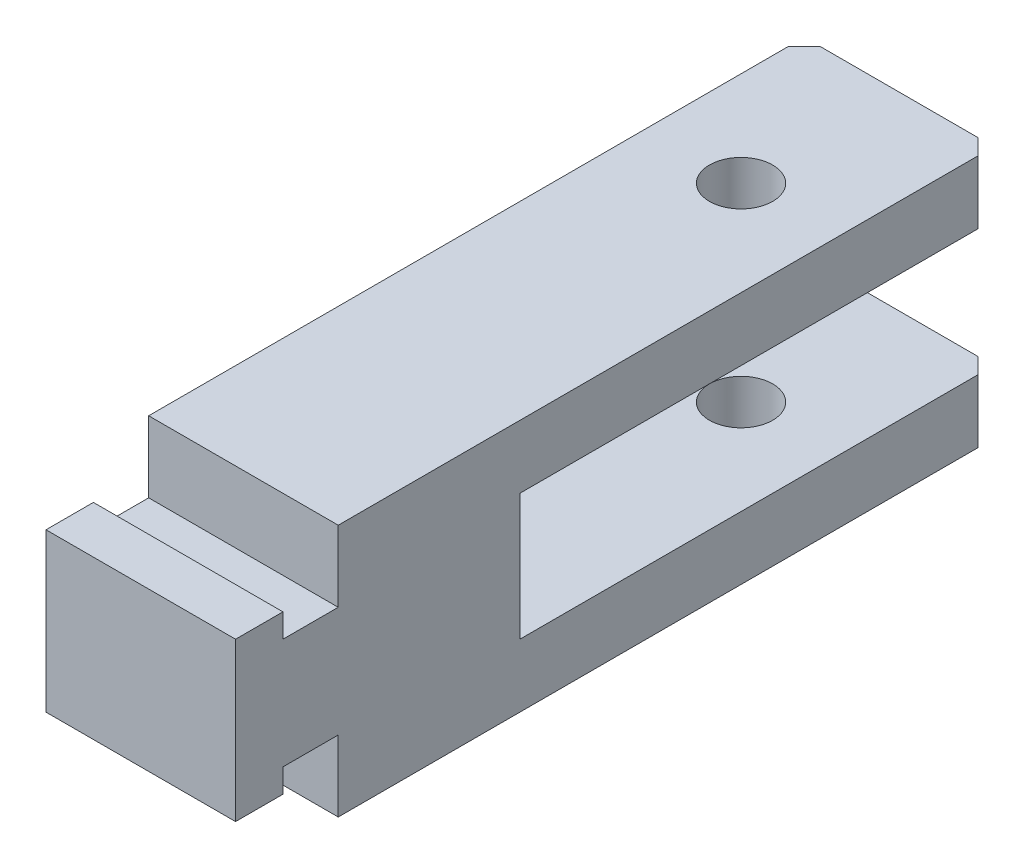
ISO-10303-21;
HEADER;
FILE_DESCRIPTION(('STEP AP214'),'2;1');
FILE_NAME('part.step','',(''),(''),'','','');
FILE_SCHEMA(('AUTOMOTIVE_DESIGN { 1 0 10303 214 1 1 1 1 }'));
ENDSEC;
DATA;
#1=APPLICATION_CONTEXT('core data for automotive mechanical design processes');
#2=APPLICATION_PROTOCOL_DEFINITION('international standard','automotive_design',2000,#1);
#3=PRODUCT_CONTEXT('',#1,'mechanical');
#4=PRODUCT('Part','Part','',(#3));
#5=PRODUCT_RELATED_PRODUCT_CATEGORY('part','',(#4));
#6=PRODUCT_DEFINITION_FORMATION('','',#4);
#7=PRODUCT_DEFINITION_CONTEXT('part definition',#1,'design');
#8=PRODUCT_DEFINITION('design','',#6,#7);
#9=PRODUCT_DEFINITION_SHAPE('','',#8);
#10=(LENGTH_UNIT() NAMED_UNIT(*) SI_UNIT(.MILLI.,.METRE.));
#11=(NAMED_UNIT(*) PLANE_ANGLE_UNIT() SI_UNIT($,.RADIAN.));
#12=(NAMED_UNIT(*) SI_UNIT($,.STERADIAN.) SOLID_ANGLE_UNIT());
#13=UNCERTAINTY_MEASURE_WITH_UNIT(LENGTH_MEASURE(1.E-05),#10,'distance_accuracy_value','');
#14=(GEOMETRIC_REPRESENTATION_CONTEXT(3) GLOBAL_UNCERTAINTY_ASSIGNED_CONTEXT((#13)) GLOBAL_UNIT_ASSIGNED_CONTEXT((#10,
#11,#12)) REPRESENTATION_CONTEXT('',''));
#15=CARTESIAN_POINT('',(0.,0.,0.));
#16=DIRECTION('',(0.,0.,1.));
#17=DIRECTION('',(1.,0.,0.));
#18=AXIS2_PLACEMENT_3D('',#15,#16,#17);
#19=CARTESIAN_POINT('',(-6.,16.,-24.));
#20=DIRECTION('',(0.,0.,1.));
#21=DIRECTION('',(1.,0.,0.));
#22=AXIS2_PLACEMENT_3D('',#19,#20,#21);
#23=PLANE('',#22);
#24=DIRECTION('',(0.,1.,0.));
#25=VECTOR('',#24,1.);
#26=CARTESIAN_POINT('',(-5.,16.,-24.));
#27=LINE('',#26,#25);
#28=CARTESIAN_POINT('',(-5.,0.,-24.));
#29=VERTEX_POINT('',#28);
#30=CARTESIAN_POINT('',(-5.,4.,-24.));
#31=VERTEX_POINT('',#30);
#32=EDGE_CURVE('E174',#29,#31,#27,.T.);
#33=ORIENTED_EDGE('',*,*,#32,.T.);
#34=DIRECTION('',(1.,0.,0.));
#35=VECTOR('',#34,1.);
#36=CARTESIAN_POINT('',(-6.,4.,-24.));
#37=LINE('',#36,#35);
#38=CARTESIAN_POINT('',(5.,4.,-24.));
#39=VERTEX_POINT('',#38);
#40=EDGE_CURVE('E253',#31,#39,#37,.T.);
#41=ORIENTED_EDGE('',*,*,#40,.T.);
#42=DIRECTION('',(0.,-1.,0.));
#43=VECTOR('',#42,1.);
#44=CARTESIAN_POINT('',(5.,16.,-24.));
#45=LINE('',#44,#43);
#46=CARTESIAN_POINT('',(5.,0.,-24.));
#47=VERTEX_POINT('',#46);
#48=EDGE_CURVE('E186',#39,#47,#45,.T.);
#49=ORIENTED_EDGE('',*,*,#48,.T.);
#50=DIRECTION('',(-1.,0.,0.));
#51=VECTOR('',#50,1.);
#52=CARTESIAN_POINT('',(-6.,0.,-24.));
#53=LINE('',#52,#51);
#54=EDGE_CURVE('E220',#47,#29,#53,.T.);
#55=ORIENTED_EDGE('',*,*,#54,.T.);
#56=EDGE_LOOP('',(#33,#41,#49,#55));
#57=FACE_BOUND('',#56,.T.);
#58=ADVANCED_FACE('F16',(#57),#23,.F.);
#59=CARTESIAN_POINT('',(0.,-9.,-14.));
#60=DIRECTION('',(0.,1.,0.));
#61=DIRECTION('',(0.,0.,1.));
#62=AXIS2_PLACEMENT_3D('',#59,#60,#61);
#63=CYLINDRICAL_SURFACE('',#62,2.);
#64=CARTESIAN_POINT('',(0.,4.,-14.));
#65=DIRECTION('',(0.,-1.,0.));
#66=DIRECTION('',(0.,0.,-1.));
#67=AXIS2_PLACEMENT_3D('',#64,#65,#66);
#68=CIRCLE('',#67,2.);
#69=CARTESIAN_POINT('',(0.,4.,-16.));
#70=VERTEX_POINT('',#69);
#71=EDGE_CURVE('E336',#70,#70,#68,.F.);
#72=ORIENTED_EDGE('',*,*,#71,.T.);
#73=EDGE_LOOP('',(#72));
#74=FACE_BOUND('',#73,.T.);
#75=CARTESIAN_POINT('',(0.,0.,-14.));
#76=DIRECTION('',(0.,-1.,0.));
#77=DIRECTION('',(0.,0.,-1.));
#78=AXIS2_PLACEMENT_3D('',#75,#76,#77);
#79=CIRCLE('',#78,2.);
#80=CARTESIAN_POINT('',(0.,0.,-16.));
#81=VERTEX_POINT('',#80);
#82=EDGE_CURVE('E180',#81,#81,#79,.T.);
#83=ORIENTED_EDGE('',*,*,#82,.T.);
#84=EDGE_LOOP('',(#83));
#85=FACE_BOUND('',#84,.T.);
#86=ADVANCED_FACE('F388',(#74,#85),#63,.F.);
#87=CARTESIAN_POINT('',(5.,16.,-24.));
#88=DIRECTION('',(-0.70710678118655,0.,0.707106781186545));
#89=DIRECTION('',(0.,-1.,0.));
#90=AXIS2_PLACEMENT_3D('',#87,#88,#89);
#91=PLANE('',#90);
#92=DIRECTION('',(0.707106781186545,0.,0.70710678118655));
#93=VECTOR('',#92,1.);
#94=CARTESIAN_POINT('',(5.,4.,-24.));
#95=LINE('',#94,#93);
#96=CARTESIAN_POINT('',(6.,4.,-23.));
#97=VERTEX_POINT('',#96);
#98=EDGE_CURVE('E331',#97,#39,#95,.F.);
#99=ORIENTED_EDGE('',*,*,#98,.F.);
#100=DIRECTION('',(0.,1.,0.));
#101=VECTOR('',#100,1.);
#102=CARTESIAN_POINT('',(6.,16.,-23.));
#103=LINE('',#102,#101);
#104=CARTESIAN_POINT('',(6.,0.,-23.));
#105=VERTEX_POINT('',#104);
#106=EDGE_CURVE('E196',#105,#97,#103,.T.);
#107=ORIENTED_EDGE('',*,*,#106,.F.);
#108=DIRECTION('',(-0.707106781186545,0.,-0.70710678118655));
#109=VECTOR('',#108,1.);
#110=CARTESIAN_POINT('',(14.5,0.,-14.5));
#111=LINE('',#110,#109);
#112=EDGE_CURVE('E192',#47,#105,#111,.F.);
#113=ORIENTED_EDGE('',*,*,#112,.F.);
#114=ORIENTED_EDGE('',*,*,#48,.F.);
#115=EDGE_LOOP('',(#99,#107,#113,#114));
#116=FACE_BOUND('',#115,.T.);
#117=ADVANCED_FACE('F384',(#116),#91,.F.);
#118=CARTESIAN_POINT('',(-6.,16.,-23.));
#119=DIRECTION('',(0.707106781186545,0.,0.70710678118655));
#120=DIRECTION('',(0.,-1.,0.));
#121=AXIS2_PLACEMENT_3D('',#118,#119,#120);
#122=PLANE('',#121);
#123=DIRECTION('',(0.70710678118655,0.,-0.707106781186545));
#124=VECTOR('',#123,1.);
#125=CARTESIAN_POINT('',(-6.,4.,-23.));
#126=LINE('',#125,#124);
#127=CARTESIAN_POINT('',(-6.,4.,-23.));
#128=VERTEX_POINT('',#127);
#129=EDGE_CURVE('E24',#31,#128,#126,.F.);
#130=ORIENTED_EDGE('',*,*,#129,.F.);
#131=ORIENTED_EDGE('',*,*,#32,.F.);
#132=DIRECTION('',(-0.70710678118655,0.,0.707106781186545));
#133=VECTOR('',#132,1.);
#134=CARTESIAN_POINT('',(-14.5,0.,-14.5));
#135=LINE('',#134,#133);
#136=CARTESIAN_POINT('',(-6.,0.,-23.));
#137=VERTEX_POINT('',#136);
#138=EDGE_CURVE('E190',#137,#29,#135,.F.);
#139=ORIENTED_EDGE('',*,*,#138,.F.);
#140=DIRECTION('',(0.,-1.,0.));
#141=VECTOR('',#140,1.);
#142=CARTESIAN_POINT('',(-6.,16.,-23.));
#143=LINE('',#142,#141);
#144=EDGE_CURVE('E203',#128,#137,#143,.T.);
#145=ORIENTED_EDGE('',*,*,#144,.F.);
#146=EDGE_LOOP('',(#130,#131,#139,#145));
#147=FACE_BOUND('',#146,.T.);
#148=ADVANCED_FACE('F264',(#147),#122,.F.);
#149=CARTESIAN_POINT('',(0.,0.,0.));
#150=DIRECTION('',(0.,-1.,0.));
#151=DIRECTION('',(0.,0.,-1.));
#152=AXIS2_PLACEMENT_3D('',#149,#150,#151);
#153=PLANE('',#152);
#154=DIRECTION('',(-1.,0.,0.));
#155=VECTOR('',#154,1.);
#156=CARTESIAN_POINT('',(11.,0.,17.5));
#157=LINE('',#156,#155);
#158=CARTESIAN_POINT('',(6.,0.,17.5));
#159=VERTEX_POINT('',#158);
#160=CARTESIAN_POINT('',(-6.,0.,17.5));
#161=VERTEX_POINT('',#160);
#162=EDGE_CURVE('E273',#159,#161,#157,.T.);
#163=ORIENTED_EDGE('',*,*,#162,.T.);
#164=DIRECTION('',(0.,0.,1.));
#165=VECTOR('',#164,1.);
#166=CARTESIAN_POINT('',(-6.,0.,24.));
#167=LINE('',#166,#165);
#168=EDGE_CURVE('E231',#137,#161,#167,.T.);
#169=ORIENTED_EDGE('',*,*,#168,.F.);
#170=ORIENTED_EDGE('',*,*,#138,.T.);
#171=ORIENTED_EDGE('',*,*,#54,.F.);
#172=ORIENTED_EDGE('',*,*,#112,.T.);
#173=DIRECTION('',(0.,0.,-1.));
#174=VECTOR('',#173,1.);
#175=CARTESIAN_POINT('',(6.,0.,24.));
#176=LINE('',#175,#174);
#177=EDGE_CURVE('E182',#159,#105,#176,.T.);
#178=ORIENTED_EDGE('',*,*,#177,.F.);
#179=EDGE_LOOP('',(#163,#169,#170,#171,#172,#178));
#180=FACE_BOUND('',#179,.T.);
#181=ORIENTED_EDGE('',*,*,#82,.F.);
#182=EDGE_LOOP('',(#181));
#183=FACE_BOUND('',#182,.T.);
#184=ADVANCED_FACE('F270',(#180,#183),#153,.T.);
#185=CARTESIAN_POINT('',(0.,16.,0.));
#186=DIRECTION('',(0.,-1.,0.));
#187=DIRECTION('',(0.,0.,-1.));
#188=AXIS2_PLACEMENT_3D('',#185,#186,#187);
#189=PLANE('',#188);
#190=CARTESIAN_POINT('',(0.,16.,-14.));
#191=DIRECTION('',(0.,1.,0.));
#192=DIRECTION('',(0.,0.,1.));
#193=AXIS2_PLACEMENT_3D('',#190,#191,#192);
#194=CIRCLE('',#193,2.);
#195=CARTESIAN_POINT('',(0.,16.,-12.));
#196=VERTEX_POINT('',#195);
#197=EDGE_CURVE('E183',#196,#196,#194,.T.);
#198=ORIENTED_EDGE('',*,*,#197,.F.);
#199=EDGE_LOOP('',(#198));
#200=FACE_BOUND('',#199,.T.);
#201=DIRECTION('',(0.,0.,1.));
#202=VECTOR('',#201,1.);
#203=CARTESIAN_POINT('',(-6.,16.,24.));
#204=LINE('',#203,#202);
#205=CARTESIAN_POINT('',(-6.,16.,-23.));
#206=VERTEX_POINT('',#205);
#207=CARTESIAN_POINT('',(-6.,16.,17.5));
#208=VERTEX_POINT('',#207);
#209=EDGE_CURVE('E176',#206,#208,#204,.T.);
#210=ORIENTED_EDGE('',*,*,#209,.T.);
#211=DIRECTION('',(-1.,0.,0.));
#212=VECTOR('',#211,1.);
#213=CARTESIAN_POINT('',(11.,16.,17.5));
#214=LINE('',#213,#212);
#215=CARTESIAN_POINT('',(6.,16.,17.5));
#216=VERTEX_POINT('',#215);
#217=EDGE_CURVE('E301',#216,#208,#214,.T.);
#218=ORIENTED_EDGE('',*,*,#217,.F.);
#219=DIRECTION('',(0.,0.,-1.));
#220=VECTOR('',#219,1.);
#221=CARTESIAN_POINT('',(6.,16.,24.));
#222=LINE('',#221,#220);
#223=CARTESIAN_POINT('',(6.,16.,-23.));
#224=VERTEX_POINT('',#223);
#225=EDGE_CURVE('E224',#216,#224,#222,.T.);
#226=ORIENTED_EDGE('',*,*,#225,.T.);
#227=DIRECTION('',(0.707106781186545,0.,0.70710678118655));
#228=VECTOR('',#227,1.);
#229=CARTESIAN_POINT('',(5.,16.,-24.));
#230=LINE('',#229,#228);
#231=CARTESIAN_POINT('',(5.,16.,-24.));
#232=VERTEX_POINT('',#231);
#233=EDGE_CURVE('E201',#224,#232,#230,.F.);
#234=ORIENTED_EDGE('',*,*,#233,.T.);
#235=DIRECTION('',(-1.,0.,0.));
#236=VECTOR('',#235,1.);
#237=CARTESIAN_POINT('',(-6.,16.,-24.));
#238=LINE('',#237,#236);
#239=CARTESIAN_POINT('',(-5.,16.,-24.));
#240=VERTEX_POINT('',#239);
#241=EDGE_CURVE('E211',#232,#240,#238,.T.);
#242=ORIENTED_EDGE('',*,*,#241,.T.);
#243=DIRECTION('',(0.70710678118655,0.,-0.707106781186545));
#244=VECTOR('',#243,1.);
#245=CARTESIAN_POINT('',(-6.,16.,-23.));
#246=LINE('',#245,#244);
#247=EDGE_CURVE('E199',#240,#206,#246,.F.);
#248=ORIENTED_EDGE('',*,*,#247,.T.);
#249=EDGE_LOOP('',(#210,#218,#226,#234,#242,#248));
#250=FACE_BOUND('',#249,.T.);
#251=ADVANCED_FACE('F347',(#200,#250),#189,.F.);
#252=CARTESIAN_POINT('',(6.,16.,24.));
#253=DIRECTION('',(-1.,0.,0.));
#254=DIRECTION('',(0.,0.,1.));
#255=AXIS2_PLACEMENT_3D('',#252,#253,#254);
#256=PLANE('',#255);
#257=DIRECTION('',(0.,-1.,0.));
#258=VECTOR('',#257,1.);
#259=CARTESIAN_POINT('',(6.,16.,24.));
#260=LINE('',#259,#258);
#261=CARTESIAN_POINT('',(6.,13.,24.));
#262=VERTEX_POINT('',#261);
#263=CARTESIAN_POINT('',(6.,3.,24.));
#264=VERTEX_POINT('',#263);
#265=EDGE_CURVE('E172',#262,#264,#260,.T.);
#266=ORIENTED_EDGE('',*,*,#265,.T.);
#267=DIRECTION('',(0.,0.,-1.));
#268=VECTOR('',#267,1.);
#269=CARTESIAN_POINT('',(6.,3.,24.));
#270=LINE('',#269,#268);
#271=CARTESIAN_POINT('',(6.,3.,21.));
#272=VERTEX_POINT('',#271);
#273=EDGE_CURVE('E153',#264,#272,#270,.T.);
#274=ORIENTED_EDGE('',*,*,#273,.T.);
#275=DIRECTION('',(0.,-1.,0.));
#276=VECTOR('',#275,1.);
#277=CARTESIAN_POINT('',(6.,0.,21.));
#278=LINE('',#277,#276);
#279=CARTESIAN_POINT('',(6.,4.5,21.));
#280=VERTEX_POINT('',#279);
#281=EDGE_CURVE('E228',#280,#272,#278,.T.);
#282=ORIENTED_EDGE('',*,*,#281,.F.);
#283=DIRECTION('',(0.,0.,-1.));
#284=VECTOR('',#283,1.);
#285=CARTESIAN_POINT('',(6.,4.5,24.));
#286=LINE('',#285,#284);
#287=CARTESIAN_POINT('',(6.,4.5,17.5));
#288=VERTEX_POINT('',#287);
#289=EDGE_CURVE('E288',#280,#288,#286,.T.);
#290=ORIENTED_EDGE('',*,*,#289,.T.);
#291=DIRECTION('',(0.,-1.,0.));
#292=VECTOR('',#291,1.);
#293=CARTESIAN_POINT('',(6.,16.,17.5));
#294=LINE('',#293,#292);
#295=EDGE_CURVE('E292',#288,#159,#294,.T.);
#296=ORIENTED_EDGE('',*,*,#295,.T.);
#297=ORIENTED_EDGE('',*,*,#177,.T.);
#298=ORIENTED_EDGE('',*,*,#106,.T.);
#299=DIRECTION('',(0.,0.,1.));
#300=VECTOR('',#299,1.);
#301=CARTESIAN_POINT('',(6.,4.,24.));
#302=LINE('',#301,#300);
#303=CARTESIAN_POINT('',(6.,4.,6.));
#304=VERTEX_POINT('',#303);
#305=EDGE_CURVE('E333',#97,#304,#302,.T.);
#306=ORIENTED_EDGE('',*,*,#305,.T.);
#307=DIRECTION('',(0.,1.,0.));
#308=VECTOR('',#307,1.);
#309=CARTESIAN_POINT('',(6.,16.,6.));
#310=LINE('',#309,#308);
#311=CARTESIAN_POINT('',(6.,12.,6.));
#312=VERTEX_POINT('',#311);
#313=EDGE_CURVE('E236',#304,#312,#310,.T.);
#314=ORIENTED_EDGE('',*,*,#313,.T.);
#315=DIRECTION('',(0.,0.,-1.));
#316=VECTOR('',#315,1.);
#317=CARTESIAN_POINT('',(6.,12.,24.));
#318=LINE('',#317,#316);
#319=CARTESIAN_POINT('',(6.,12.,-23.));
#320=VERTEX_POINT('',#319);
#321=EDGE_CURVE('E324',#312,#320,#318,.T.);
#322=ORIENTED_EDGE('',*,*,#321,.T.);
#323=EDGE_CURVE('E195',#320,#224,#103,.T.);
#324=ORIENTED_EDGE('',*,*,#323,.T.);
#325=ORIENTED_EDGE('',*,*,#225,.F.);
#326=DIRECTION('',(0.,-1.,0.));
#327=VECTOR('',#326,1.);
#328=CARTESIAN_POINT('',(6.,16.,17.5));
#329=LINE('',#328,#327);
#330=CARTESIAN_POINT('',(6.,11.5,17.5));
#331=VERTEX_POINT('',#330);
#332=EDGE_CURVE('E305',#216,#331,#329,.T.);
#333=ORIENTED_EDGE('',*,*,#332,.T.);
#334=DIRECTION('',(0.,0.,1.));
#335=VECTOR('',#334,1.);
#336=CARTESIAN_POINT('',(6.,11.5,24.));
#337=LINE('',#336,#335);
#338=CARTESIAN_POINT('',(6.,11.5,21.));
#339=VERTEX_POINT('',#338);
#340=EDGE_CURVE('E311',#331,#339,#337,.T.);
#341=ORIENTED_EDGE('',*,*,#340,.T.);
#342=DIRECTION('',(0.,-1.,0.));
#343=VECTOR('',#342,1.);
#344=CARTESIAN_POINT('',(6.,16.,21.));
#345=LINE('',#344,#343);
#346=CARTESIAN_POINT('',(6.,13.,21.));
#347=VERTEX_POINT('',#346);
#348=EDGE_CURVE('E227',#347,#339,#345,.T.);
#349=ORIENTED_EDGE('',*,*,#348,.F.);
#350=DIRECTION('',(0.,0.,1.));
#351=VECTOR('',#350,1.);
#352=CARTESIAN_POINT('',(6.,13.,24.));
#353=LINE('',#352,#351);
#354=EDGE_CURVE('E38',#347,#262,#353,.T.);
#355=ORIENTED_EDGE('',*,*,#354,.T.);
#356=EDGE_LOOP('',(#266,#274,#282,#290,#296,#297,#298,#306,#314,#322,#324,#325,#333,#341,#349,#355));
#357=FACE_BOUND('',#356,.T.);
#358=ADVANCED_FACE('F350',(#357),#256,.F.);
#359=CARTESIAN_POINT('',(5.,12.,-24.));
#360=VERTEX_POINT('',#359);
#361=EDGE_CURVE('E187',#232,#360,#45,.T.);
#362=ORIENTED_EDGE('',*,*,#361,.T.);
#363=DIRECTION('',(-1.,0.,0.));
#364=VECTOR('',#363,1.);
#365=CARTESIAN_POINT('',(-6.,12.,-24.));
#366=LINE('',#365,#364);
#367=CARTESIAN_POINT('',(-5.,12.,-24.));
#368=VERTEX_POINT('',#367);
#369=EDGE_CURVE('E318',#360,#368,#366,.T.);
#370=ORIENTED_EDGE('',*,*,#369,.T.);
#371=EDGE_CURVE('E171',#368,#240,#27,.T.);
#372=ORIENTED_EDGE('',*,*,#371,.T.);
#373=ORIENTED_EDGE('',*,*,#241,.F.);
#374=EDGE_LOOP('',(#362,#370,#372,#373));
#375=FACE_BOUND('',#374,.T.);
#376=ADVANCED_FACE('F368',(#375),#23,.F.);
#377=CARTESIAN_POINT('',(-6.,16.,24.));
#378=DIRECTION('',(1.,0.,0.));
#379=DIRECTION('',(0.,0.,-1.));
#380=AXIS2_PLACEMENT_3D('',#377,#378,#379);
#381=PLANE('',#380);
#382=DIRECTION('',(0.,-1.,0.));
#383=VECTOR('',#382,1.);
#384=CARTESIAN_POINT('',(-6.,0.,21.));
#385=LINE('',#384,#383);
#386=CARTESIAN_POINT('',(-6.,4.5,21.));
#387=VERTEX_POINT('',#386);
#388=CARTESIAN_POINT('',(-6.,3.,21.));
#389=VERTEX_POINT('',#388);
#390=EDGE_CURVE('E166',#387,#389,#385,.T.);
#391=ORIENTED_EDGE('',*,*,#390,.T.);
#392=DIRECTION('',(0.,0.,-1.));
#393=VECTOR('',#392,1.);
#394=CARTESIAN_POINT('',(-6.,3.,21.));
#395=LINE('',#394,#393);
#396=CARTESIAN_POINT('',(-6.,3.,24.));
#397=VERTEX_POINT('',#396);
#398=EDGE_CURVE('E30',#397,#389,#395,.T.);
#399=ORIENTED_EDGE('',*,*,#398,.F.);
#400=DIRECTION('',(0.,-1.,0.));
#401=VECTOR('',#400,1.);
#402=CARTESIAN_POINT('',(-6.,16.,24.));
#403=LINE('',#402,#401);
#404=CARTESIAN_POINT('',(-6.,13.,24.));
#405=VERTEX_POINT('',#404);
#406=EDGE_CURVE('E164',#405,#397,#403,.T.);
#407=ORIENTED_EDGE('',*,*,#406,.F.);
#408=DIRECTION('',(0.,0.,1.));
#409=VECTOR('',#408,1.);
#410=CARTESIAN_POINT('',(-6.,13.,21.));
#411=LINE('',#410,#409);
#412=CARTESIAN_POINT('',(-6.,13.,21.));
#413=VERTEX_POINT('',#412);
#414=EDGE_CURVE('E594',#413,#405,#411,.T.);
#415=ORIENTED_EDGE('',*,*,#414,.F.);
#416=DIRECTION('',(0.,-1.,0.));
#417=VECTOR('',#416,1.);
#418=CARTESIAN_POINT('',(-6.,16.,21.));
#419=LINE('',#418,#417);
#420=CARTESIAN_POINT('',(-6.,11.5,21.));
#421=VERTEX_POINT('',#420);
#422=EDGE_CURVE('E226',#413,#421,#419,.T.);
#423=ORIENTED_EDGE('',*,*,#422,.T.);
#424=DIRECTION('',(0.,0.,1.));
#425=VECTOR('',#424,1.);
#426=CARTESIAN_POINT('',(-6.,11.5,21.));
#427=LINE('',#426,#425);
#428=CARTESIAN_POINT('',(-6.,11.5,17.5));
#429=VERTEX_POINT('',#428);
#430=EDGE_CURVE('E298',#429,#421,#427,.T.);
#431=ORIENTED_EDGE('',*,*,#430,.F.);
#432=DIRECTION('',(0.,-1.,0.));
#433=VECTOR('',#432,1.);
#434=CARTESIAN_POINT('',(-6.,16.,17.5));
#435=LINE('',#434,#433);
#436=EDGE_CURVE('E295',#208,#429,#435,.T.);
#437=ORIENTED_EDGE('',*,*,#436,.F.);
#438=ORIENTED_EDGE('',*,*,#209,.F.);
#439=CARTESIAN_POINT('',(-6.,12.,-23.));
#440=VERTEX_POINT('',#439);
#441=EDGE_CURVE('E204',#206,#440,#143,.T.);
#442=ORIENTED_EDGE('',*,*,#441,.T.);
#443=DIRECTION('',(0.,0.,-1.));
#444=VECTOR('',#443,1.);
#445=CARTESIAN_POINT('',(-6.,12.,-54.));
#446=LINE('',#445,#444);
#447=CARTESIAN_POINT('',(-6.,12.,6.));
#448=VERTEX_POINT('',#447);
#449=EDGE_CURVE('E262',#448,#440,#446,.T.);
#450=ORIENTED_EDGE('',*,*,#449,.F.);
#451=DIRECTION('',(0.,1.,0.));
#452=VECTOR('',#451,1.);
#453=CARTESIAN_POINT('',(-6.,12.,6.));
#454=LINE('',#453,#452);
#455=CARTESIAN_POINT('',(-6.,4.,6.));
#456=VERTEX_POINT('',#455);
#457=EDGE_CURVE('E260',#456,#448,#454,.T.);
#458=ORIENTED_EDGE('',*,*,#457,.F.);
#459=DIRECTION('',(0.,0.,1.));
#460=VECTOR('',#459,1.);
#461=CARTESIAN_POINT('',(-6.,4.,-54.));
#462=LINE('',#461,#460);
#463=EDGE_CURVE('E250',#128,#456,#462,.T.);
#464=ORIENTED_EDGE('',*,*,#463,.F.);
#465=ORIENTED_EDGE('',*,*,#144,.T.);
#466=ORIENTED_EDGE('',*,*,#168,.T.);
#467=DIRECTION('',(0.,-1.,0.));
#468=VECTOR('',#467,1.);
#469=CARTESIAN_POINT('',(-6.,0.,17.5));
#470=LINE('',#469,#468);
#471=CARTESIAN_POINT('',(-6.,4.5,17.5));
#472=VERTEX_POINT('',#471);
#473=EDGE_CURVE('E275',#472,#161,#470,.T.);
#474=ORIENTED_EDGE('',*,*,#473,.F.);
#475=DIRECTION('',(0.,0.,-1.));
#476=VECTOR('',#475,1.);
#477=CARTESIAN_POINT('',(-6.,4.5,21.));
#478=LINE('',#477,#476);
#479=EDGE_CURVE('E277',#387,#472,#478,.T.);
#480=ORIENTED_EDGE('',*,*,#479,.F.);
#481=EDGE_LOOP('',(#391,#399,#407,#415,#423,#431,#437,#438,#442,#450,#458,#464,#465,#466,#474,#480));
#482=FACE_BOUND('',#481,.T.);
#483=ADVANCED_FACE('F162',(#482),#381,.F.);
#484=CARTESIAN_POINT('',(-6.,16.,24.));
#485=DIRECTION('',(0.,0.,-1.));
#486=DIRECTION('',(-1.,0.,0.));
#487=AXIS2_PLACEMENT_3D('',#484,#485,#486);
#488=PLANE('',#487);
#489=ORIENTED_EDGE('',*,*,#406,.T.);
#490=DIRECTION('',(-1.,0.,0.));
#491=VECTOR('',#490,1.);
#492=CARTESIAN_POINT('',(11.,3.,24.));
#493=LINE('',#492,#491);
#494=EDGE_CURVE('E150',#264,#397,#493,.T.);
#495=ORIENTED_EDGE('',*,*,#494,.F.);
#496=ORIENTED_EDGE('',*,*,#265,.F.);
#497=DIRECTION('',(-1.,0.,0.));
#498=VECTOR('',#497,1.);
#499=CARTESIAN_POINT('',(11.,13.,24.));
#500=LINE('',#499,#498);
#501=EDGE_CURVE('E170',#262,#405,#500,.T.);
#502=ORIENTED_EDGE('',*,*,#501,.T.);
#503=EDGE_LOOP('',(#489,#495,#496,#502));
#504=FACE_BOUND('',#503,.T.);
#505=ADVANCED_FACE('F169',(#504),#488,.F.);
#506=CARTESIAN_POINT('',(0.,12.,-14.));
#507=DIRECTION('',(0.,1.,0.));
#508=DIRECTION('',(0.,0.,1.));
#509=AXIS2_PLACEMENT_3D('',#506,#507,#508);
#510=CIRCLE('',#509,2.);
#511=CARTESIAN_POINT('',(0.,12.,-12.));
#512=VERTEX_POINT('',#511);
#513=EDGE_CURVE('E327',#512,#512,#510,.F.);
#514=ORIENTED_EDGE('',*,*,#513,.T.);
#515=EDGE_LOOP('',(#514));
#516=FACE_BOUND('',#515,.T.);
#517=ORIENTED_EDGE('',*,*,#197,.T.);
#518=EDGE_LOOP('',(#517));
#519=FACE_BOUND('',#518,.T.);
#520=ADVANCED_FACE('F345',(#516,#519),#63,.F.);
#521=DIRECTION('',(-0.707106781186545,0.,-0.70710678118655));
#522=VECTOR('',#521,1.);
#523=CARTESIAN_POINT('',(5.,12.,-24.));
#524=LINE('',#523,#522);
#525=EDGE_CURVE('E322',#360,#320,#524,.F.);
#526=ORIENTED_EDGE('',*,*,#525,.F.);
#527=ORIENTED_EDGE('',*,*,#361,.F.);
#528=ORIENTED_EDGE('',*,*,#233,.F.);
#529=ORIENTED_EDGE('',*,*,#323,.F.);
#530=EDGE_LOOP('',(#526,#527,#528,#529));
#531=FACE_BOUND('',#530,.T.);
#532=ADVANCED_FACE('F373',(#531),#91,.F.);
#533=DIRECTION('',(-0.70710678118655,0.,0.707106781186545));
#534=VECTOR('',#533,1.);
#535=CARTESIAN_POINT('',(-6.,12.,-23.));
#536=LINE('',#535,#534);
#537=EDGE_CURVE('E207',#440,#368,#536,.F.);
#538=ORIENTED_EDGE('',*,*,#537,.F.);
#539=ORIENTED_EDGE('',*,*,#441,.F.);
#540=ORIENTED_EDGE('',*,*,#247,.F.);
#541=ORIENTED_EDGE('',*,*,#371,.F.);
#542=EDGE_LOOP('',(#538,#539,#540,#541));
#543=FACE_BOUND('',#542,.T.);
#544=ADVANCED_FACE('F18',(#543),#122,.F.);
#545=CARTESIAN_POINT('',(6.,16.,21.));
#546=DIRECTION('',(0.,0.,-1.));
#547=DIRECTION('',(-1.,0.,0.));
#548=AXIS2_PLACEMENT_3D('',#545,#546,#547);
#549=PLANE('',#548);
#550=DIRECTION('',(-1.,0.,0.));
#551=VECTOR('',#550,1.);
#552=CARTESIAN_POINT('',(11.,13.,21.));
#553=LINE('',#552,#551);
#554=EDGE_CURVE('E593',#347,#413,#553,.T.);
#555=ORIENTED_EDGE('',*,*,#554,.F.);
#556=ORIENTED_EDGE('',*,*,#348,.T.);
#557=DIRECTION('',(-1.,0.,0.));
#558=VECTOR('',#557,1.);
#559=CARTESIAN_POINT('',(11.,11.5,21.));
#560=LINE('',#559,#558);
#561=EDGE_CURVE('E302',#339,#421,#560,.T.);
#562=ORIENTED_EDGE('',*,*,#561,.T.);
#563=ORIENTED_EDGE('',*,*,#422,.F.);
#564=EDGE_LOOP('',(#555,#556,#562,#563));
#565=FACE_BOUND('',#564,.T.);
#566=ADVANCED_FACE('F414',(#565),#549,.T.);
#567=CARTESIAN_POINT('',(6.,0.,21.));
#568=DIRECTION('',(0.,0.,-1.));
#569=DIRECTION('',(-1.,0.,0.));
#570=AXIS2_PLACEMENT_3D('',#567,#568,#569);
#571=PLANE('',#570);
#572=DIRECTION('',(1.,0.,0.));
#573=VECTOR('',#572,1.);
#574=CARTESIAN_POINT('',(6.,3.,21.));
#575=LINE('',#574,#573);
#576=EDGE_CURVE('E11',#389,#272,#575,.T.);
#577=ORIENTED_EDGE('',*,*,#576,.F.);
#578=ORIENTED_EDGE('',*,*,#390,.F.);
#579=DIRECTION('',(-1.,0.,0.));
#580=VECTOR('',#579,1.);
#581=CARTESIAN_POINT('',(11.,4.5,21.));
#582=LINE('',#581,#580);
#583=EDGE_CURVE('E279',#280,#387,#582,.T.);
#584=ORIENTED_EDGE('',*,*,#583,.F.);
#585=ORIENTED_EDGE('',*,*,#281,.T.);
#586=EDGE_LOOP('',(#577,#578,#584,#585));
#587=FACE_BOUND('',#586,.T.);
#588=ADVANCED_FACE('F466',(#587),#571,.T.);
#589=CARTESIAN_POINT('',(10.,12.,6.));
#590=DIRECTION('',(0.,0.,1.));
#591=DIRECTION('',(0.,-1.,0.));
#592=AXIS2_PLACEMENT_3D('',#589,#590,#591);
#593=PLANE('',#592);
#594=DIRECTION('',(-1.,0.,0.));
#595=VECTOR('',#594,1.);
#596=CARTESIAN_POINT('',(10.,4.,6.));
#597=LINE('',#596,#595);
#598=EDGE_CURVE('E316',#304,#456,#597,.T.);
#599=ORIENTED_EDGE('',*,*,#598,.T.);
#600=ORIENTED_EDGE('',*,*,#457,.T.);
#601=DIRECTION('',(-1.,0.,0.));
#602=VECTOR('',#601,1.);
#603=CARTESIAN_POINT('',(10.,12.,6.));
#604=LINE('',#603,#602);
#605=EDGE_CURVE('E261',#312,#448,#604,.T.);
#606=ORIENTED_EDGE('',*,*,#605,.F.);
#607=ORIENTED_EDGE('',*,*,#313,.F.);
#608=EDGE_LOOP('',(#599,#600,#606,#607));
#609=FACE_BOUND('',#608,.T.);
#610=ADVANCED_FACE('F379',(#609),#593,.F.);
#611=CARTESIAN_POINT('',(10.,4.,-54.));
#612=DIRECTION('',(0.,-1.,0.));
#613=DIRECTION('',(0.,0.,-1.));
#614=AXIS2_PLACEMENT_3D('',#611,#612,#613);
#615=PLANE('',#614);
#616=ORIENTED_EDGE('',*,*,#98,.T.);
#617=ORIENTED_EDGE('',*,*,#40,.F.);
#618=ORIENTED_EDGE('',*,*,#129,.T.);
#619=ORIENTED_EDGE('',*,*,#463,.T.);
#620=ORIENTED_EDGE('',*,*,#598,.F.);
#621=ORIENTED_EDGE('',*,*,#305,.F.);
#622=EDGE_LOOP('',(#616,#617,#618,#619,#620,#621));
#623=FACE_BOUND('',#622,.T.);
#624=ORIENTED_EDGE('',*,*,#71,.F.);
#625=EDGE_LOOP('',(#624));
#626=FACE_BOUND('',#625,.T.);
#627=ADVANCED_FACE('F247',(#623,#626),#615,.F.);
#628=CARTESIAN_POINT('',(10.,12.,-54.));
#629=DIRECTION('',(0.,1.,0.));
#630=DIRECTION('',(0.,0.,1.));
#631=AXIS2_PLACEMENT_3D('',#628,#629,#630);
#632=PLANE('',#631);
#633=ORIENTED_EDGE('',*,*,#605,.T.);
#634=ORIENTED_EDGE('',*,*,#449,.T.);
#635=ORIENTED_EDGE('',*,*,#537,.T.);
#636=ORIENTED_EDGE('',*,*,#369,.F.);
#637=ORIENTED_EDGE('',*,*,#525,.T.);
#638=ORIENTED_EDGE('',*,*,#321,.F.);
#639=EDGE_LOOP('',(#633,#634,#635,#636,#637,#638));
#640=FACE_BOUND('',#639,.T.);
#641=ORIENTED_EDGE('',*,*,#513,.F.);
#642=EDGE_LOOP('',(#641));
#643=FACE_BOUND('',#642,.T.);
#644=ADVANCED_FACE('F364',(#640,#643),#632,.F.);
#645=CARTESIAN_POINT('',(11.,11.5,21.));
#646=DIRECTION('',(0.,-1.,0.));
#647=DIRECTION('',(0.,0.,-1.));
#648=AXIS2_PLACEMENT_3D('',#645,#646,#647);
#649=PLANE('',#648);
#650=DIRECTION('',(-1.,0.,0.));
#651=VECTOR('',#650,1.);
#652=CARTESIAN_POINT('',(11.,11.5,17.5));
#653=LINE('',#652,#651);
#654=EDGE_CURVE('E306',#331,#429,#653,.T.);
#655=ORIENTED_EDGE('',*,*,#654,.T.);
#656=ORIENTED_EDGE('',*,*,#430,.T.);
#657=ORIENTED_EDGE('',*,*,#561,.F.);
#658=ORIENTED_EDGE('',*,*,#340,.F.);
#659=EDGE_LOOP('',(#655,#656,#657,#658));
#660=FACE_BOUND('',#659,.T.);
#661=ADVANCED_FACE('F503',(#660),#649,.F.);
#662=CARTESIAN_POINT('',(11.,16.,17.5));
#663=DIRECTION('',(0.,0.,-1.));
#664=DIRECTION('',(-1.,0.,0.));
#665=AXIS2_PLACEMENT_3D('',#662,#663,#664);
#666=PLANE('',#665);
#667=ORIENTED_EDGE('',*,*,#217,.T.);
#668=ORIENTED_EDGE('',*,*,#436,.T.);
#669=ORIENTED_EDGE('',*,*,#654,.F.);
#670=ORIENTED_EDGE('',*,*,#332,.F.);
#671=EDGE_LOOP('',(#667,#668,#669,#670));
#672=FACE_BOUND('',#671,.T.);
#673=ADVANCED_FACE('F512',(#672),#666,.F.);
#674=CARTESIAN_POINT('',(11.,0.,17.5));
#675=DIRECTION('',(0.,0.,-1.));
#676=DIRECTION('',(-1.,0.,0.));
#677=AXIS2_PLACEMENT_3D('',#674,#675,#676);
#678=PLANE('',#677);
#679=DIRECTION('',(-1.,0.,0.));
#680=VECTOR('',#679,1.);
#681=CARTESIAN_POINT('',(11.,4.5,17.5));
#682=LINE('',#681,#680);
#683=EDGE_CURVE('E282',#288,#472,#682,.T.);
#684=ORIENTED_EDGE('',*,*,#683,.T.);
#685=ORIENTED_EDGE('',*,*,#473,.T.);
#686=ORIENTED_EDGE('',*,*,#162,.F.);
#687=ORIENTED_EDGE('',*,*,#295,.F.);
#688=EDGE_LOOP('',(#684,#685,#686,#687));
#689=FACE_BOUND('',#688,.T.);
#690=ADVANCED_FACE('F522',(#689),#678,.F.);
#691=CARTESIAN_POINT('',(11.,4.5,21.));
#692=DIRECTION('',(0.,1.,0.));
#693=DIRECTION('',(0.,0.,1.));
#694=AXIS2_PLACEMENT_3D('',#691,#692,#693);
#695=PLANE('',#694);
#696=ORIENTED_EDGE('',*,*,#583,.T.);
#697=ORIENTED_EDGE('',*,*,#479,.T.);
#698=ORIENTED_EDGE('',*,*,#683,.F.);
#699=ORIENTED_EDGE('',*,*,#289,.F.);
#700=EDGE_LOOP('',(#696,#697,#698,#699));
#701=FACE_BOUND('',#700,.T.);
#702=ADVANCED_FACE('F533',(#701),#695,.F.);
#703=CARTESIAN_POINT('',(11.,13.,21.));
#704=DIRECTION('',(0.,-1.,0.));
#705=DIRECTION('',(0.,0.,-1.));
#706=AXIS2_PLACEMENT_3D('',#703,#704,#705);
#707=PLANE('',#706);
#708=ORIENTED_EDGE('',*,*,#554,.T.);
#709=ORIENTED_EDGE('',*,*,#414,.T.);
#710=ORIENTED_EDGE('',*,*,#501,.F.);
#711=ORIENTED_EDGE('',*,*,#354,.F.);
#712=EDGE_LOOP('',(#708,#709,#710,#711));
#713=FACE_BOUND('',#712,.T.);
#714=ADVANCED_FACE('F542',(#713),#707,.F.);
#715=CARTESIAN_POINT('',(11.,3.,21.));
#716=DIRECTION('',(0.,1.,0.));
#717=DIRECTION('',(0.,0.,1.));
#718=AXIS2_PLACEMENT_3D('',#715,#716,#717);
#719=PLANE('',#718);
#720=ORIENTED_EDGE('',*,*,#494,.T.);
#721=ORIENTED_EDGE('',*,*,#398,.T.);
#722=ORIENTED_EDGE('',*,*,#576,.T.);
#723=ORIENTED_EDGE('',*,*,#273,.F.);
#724=EDGE_LOOP('',(#720,#721,#722,#723));
#725=FACE_BOUND('',#724,.T.);
#726=ADVANCED_FACE('F151',(#725),#719,.F.);
#727=CLOSED_SHELL('',(#58,#86,#117,#148,#184,#251,#358,#376,#483,#505,#520,#532,#544,#566,#588,
#610,#627,#644,#661,#673,#690,#702,#714,#726));
#728=MANIFOLD_SOLID_BREP('B1',#727);
#729=ADVANCED_BREP_SHAPE_REPRESENTATION('',(#18,#728),#14);
#730=SHAPE_DEFINITION_REPRESENTATION(#9,#729);
ENDSEC;
END-ISO-10303-21;
